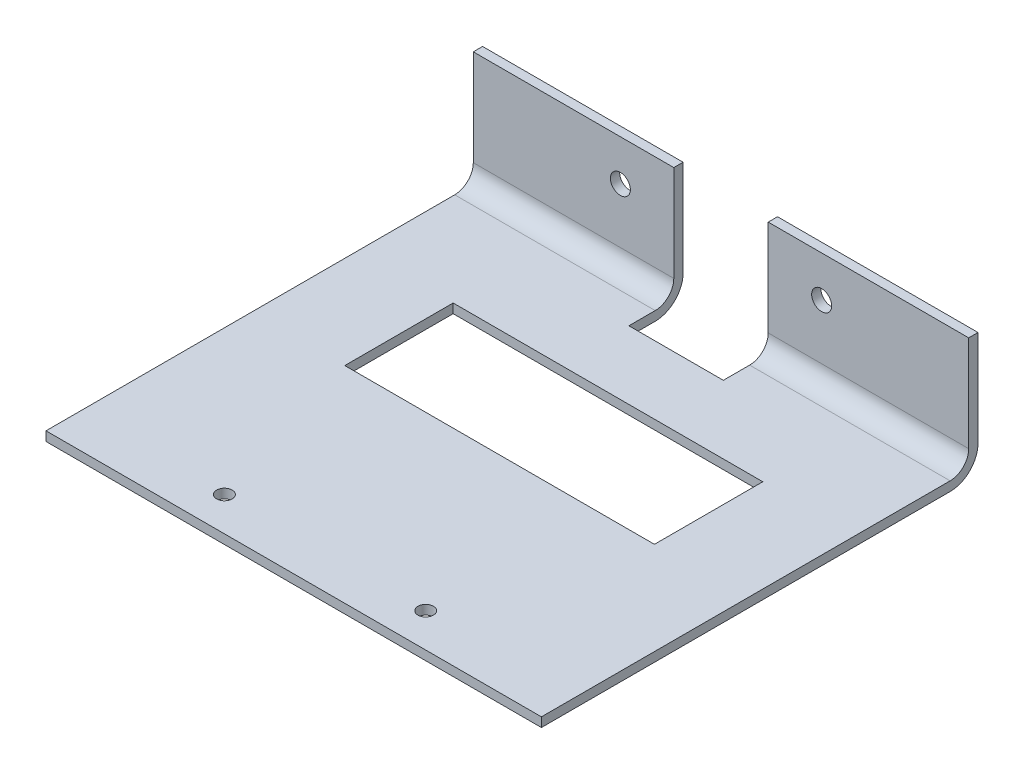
ISO-10303-21;
HEADER;
FILE_DESCRIPTION(('STEP AP214'),'2;1');
FILE_NAME('part.step','',(''),(''),'','','');
FILE_SCHEMA(('AUTOMOTIVE_DESIGN { 1 0 10303 214 1 1 1 1 }'));
ENDSEC;
DATA;
#1=APPLICATION_CONTEXT('core data for automotive mechanical design processes');
#2=APPLICATION_PROTOCOL_DEFINITION('international standard','automotive_design',2000,#1);
#3=PRODUCT_CONTEXT('',#1,'mechanical');
#4=PRODUCT('Part','Part','',(#3));
#5=PRODUCT_RELATED_PRODUCT_CATEGORY('part','',(#4));
#6=PRODUCT_DEFINITION_FORMATION('','',#4);
#7=PRODUCT_DEFINITION_CONTEXT('part definition',#1,'design');
#8=PRODUCT_DEFINITION('design','',#6,#7);
#9=PRODUCT_DEFINITION_SHAPE('','',#8);
#10=(LENGTH_UNIT() NAMED_UNIT(*) SI_UNIT(.MILLI.,.METRE.));
#11=(NAMED_UNIT(*) PLANE_ANGLE_UNIT() SI_UNIT($,.RADIAN.));
#12=(NAMED_UNIT(*) SI_UNIT($,.STERADIAN.) SOLID_ANGLE_UNIT());
#13=UNCERTAINTY_MEASURE_WITH_UNIT(LENGTH_MEASURE(1.E-05),#10,'distance_accuracy_value','');
#14=(GEOMETRIC_REPRESENTATION_CONTEXT(3) GLOBAL_UNCERTAINTY_ASSIGNED_CONTEXT((#13)) GLOBAL_UNIT_ASSIGNED_CONTEXT((#10,
#11,#12)) REPRESENTATION_CONTEXT('',''));
#15=CARTESIAN_POINT('',(0.,0.,0.));
#16=DIRECTION('',(0.,0.,1.));
#17=DIRECTION('',(1.,0.,0.));
#18=AXIS2_PLACEMENT_3D('',#15,#16,#17);
#19=CARTESIAN_POINT('',(160.,-53.6,0.));
#20=DIRECTION('',(0.,0.,-1.));
#21=DIRECTION('',(0.,1.,0.));
#22=AXIS2_PLACEMENT_3D('',#19,#20,#21);
#23=PLANE('',#22);
#24=DIRECTION('',(0.,-1.,0.));
#25=VECTOR('',#24,1.);
#26=CARTESIAN_POINT('',(30.5,-53.6,0.));
#27=LINE('',#26,#25);
#28=CARTESIAN_POINT('',(30.5,26.4,0.));
#29=VERTEX_POINT('',#28);
#30=CARTESIAN_POINT('',(30.5,-35.6,0.));
#31=VERTEX_POINT('',#30);
#32=EDGE_CURVE('E210',#29,#31,#27,.T.);
#33=ORIENTED_EDGE('',*,*,#32,.F.);
#34=DIRECTION('',(-1.,0.,0.));
#35=VECTOR('',#34,1.);
#36=CARTESIAN_POINT('',(160.,26.4,0.));
#37=LINE('',#36,#35);
#38=CARTESIAN_POINT('',(160.,26.4,0.));
#39=VERTEX_POINT('',#38);
#40=EDGE_CURVE('E290',#39,#29,#37,.T.);
#41=ORIENTED_EDGE('',*,*,#40,.F.);
#42=DIRECTION('',(0.,-1.,0.));
#43=VECTOR('',#42,1.);
#44=CARTESIAN_POINT('',(160.,-53.6,0.));
#45=LINE('',#44,#43);
#46=CARTESIAN_POINT('',(160.,-35.6,0.));
#47=VERTEX_POINT('',#46);
#48=EDGE_CURVE('E276',#39,#47,#45,.T.);
#49=ORIENTED_EDGE('',*,*,#48,.T.);
#50=DIRECTION('',(-1.,0.,0.));
#51=VECTOR('',#50,1.);
#52=CARTESIAN_POINT('',(160.,-35.6,0.));
#53=LINE('',#52,#51);
#54=EDGE_CURVE('E312',#47,#31,#53,.T.);
#55=ORIENTED_EDGE('',*,*,#54,.T.);
#56=EDGE_LOOP('',(#33,#41,#49,#55));
#57=FACE_BOUND('',#56,.T.);
#58=CARTESIAN_POINT('',(65.,0.,0.));
#59=DIRECTION('',(0.,0.,1.));
#60=DIRECTION('',(0.,1.,0.));
#61=AXIS2_PLACEMENT_3D('',#58,#59,#60);
#62=CIRCLE('',#61,6.45);
#63=CARTESIAN_POINT('',(65.,6.44999999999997,0.));
#64=VERTEX_POINT('',#63);
#65=EDGE_CURVE('E333',#64,#64,#62,.T.);
#66=ORIENTED_EDGE('',*,*,#65,.T.);
#67=EDGE_LOOP('',(#66));
#68=FACE_BOUND('',#67,.T.);
#69=ADVANCED_FACE('F35',(#57,#68),#23,.T.);
#70=CARTESIAN_POINT('',(160.,-53.6,6.));
#71=DIRECTION('',(0.,0.,-1.));
#72=DIRECTION('',(0.,1.,0.));
#73=AXIS2_PLACEMENT_3D('',#70,#71,#72);
#74=PLANE('',#73);
#75=DIRECTION('',(-1.,0.,0.));
#76=VECTOR('',#75,1.);
#77=CARTESIAN_POINT('',(160.,26.4,6.));
#78=LINE('',#77,#76);
#79=CARTESIAN_POINT('',(160.,26.4,6.));
#80=VERTEX_POINT('',#79);
#81=CARTESIAN_POINT('',(30.5,26.4,6.));
#82=VERTEX_POINT('',#81);
#83=EDGE_CURVE('E286',#80,#82,#78,.T.);
#84=ORIENTED_EDGE('',*,*,#83,.T.);
#85=DIRECTION('',(0.,-1.,0.));
#86=VECTOR('',#85,1.);
#87=CARTESIAN_POINT('',(30.5,-53.6,6.));
#88=LINE('',#87,#86);
#89=CARTESIAN_POINT('',(30.5,-35.6,6.));
#90=VERTEX_POINT('',#89);
#91=EDGE_CURVE('E215',#82,#90,#88,.T.);
#92=ORIENTED_EDGE('',*,*,#91,.T.);
#93=DIRECTION('',(-1.,0.,0.));
#94=VECTOR('',#93,1.);
#95=CARTESIAN_POINT('',(160.,-35.6,6.));
#96=LINE('',#95,#94);
#97=CARTESIAN_POINT('',(160.,-35.6,6.));
#98=VERTEX_POINT('',#97);
#99=EDGE_CURVE('E303',#90,#98,#96,.F.);
#100=ORIENTED_EDGE('',*,*,#99,.T.);
#101=DIRECTION('',(0.,-1.,0.));
#102=VECTOR('',#101,1.);
#103=CARTESIAN_POINT('',(160.,-53.6,6.));
#104=LINE('',#103,#102);
#105=EDGE_CURVE('E282',#80,#98,#104,.T.);
#106=ORIENTED_EDGE('',*,*,#105,.F.);
#107=EDGE_LOOP('',(#84,#92,#100,#106));
#108=FACE_BOUND('',#107,.T.);
#109=CARTESIAN_POINT('',(65.,0.,6.00000000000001));
#110=DIRECTION('',(0.,0.,-1.));
#111=DIRECTION('',(0.,1.,0.));
#112=AXIS2_PLACEMENT_3D('',#109,#110,#111);
#113=CIRCLE('',#112,6.45);
#114=CARTESIAN_POINT('',(65.,6.44999999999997,6.00000000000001));
#115=VERTEX_POINT('',#114);
#116=EDGE_CURVE('E39',#115,#115,#113,.F.);
#117=ORIENTED_EDGE('',*,*,#116,.F.);
#118=EDGE_LOOP('',(#117));
#119=FACE_BOUND('',#118,.T.);
#120=ADVANCED_FACE('F406',(#108,#119),#74,.F.);
#121=CARTESIAN_POINT('',(160.,26.4,6.));
#122=DIRECTION('',(0.,1.,0.));
#123=DIRECTION('',(0.,0.,1.));
#124=AXIS2_PLACEMENT_3D('',#121,#122,#123);
#125=PLANE('',#124);
#126=DIRECTION('',(0.,0.,-1.));
#127=VECTOR('',#126,1.);
#128=CARTESIAN_POINT('',(30.5,26.4,-40.));
#129=LINE('',#128,#127);
#130=EDGE_CURVE('E323',#82,#29,#129,.T.);
#131=ORIENTED_EDGE('',*,*,#130,.F.);
#132=ORIENTED_EDGE('',*,*,#83,.F.);
#133=DIRECTION('',(0.,0.,-1.));
#134=VECTOR('',#133,1.);
#135=CARTESIAN_POINT('',(160.,26.4,6.));
#136=LINE('',#135,#134);
#137=EDGE_CURVE('E279',#80,#39,#136,.T.);
#138=ORIENTED_EDGE('',*,*,#137,.T.);
#139=ORIENTED_EDGE('',*,*,#40,.T.);
#140=EDGE_LOOP('',(#131,#132,#138,#139));
#141=FACE_BOUND('',#140,.T.);
#142=ADVANCED_FACE('F375',(#141),#125,.T.);
#143=CARTESIAN_POINT('',(160.,-35.6,18.));
#144=DIRECTION('',(1.,0.,0.));
#145=DIRECTION('',(0.,0.,-1.));
#146=AXIS2_PLACEMENT_3D('',#143,#144,#145);
#147=CYLINDRICAL_SURFACE('',#146,12.);
#148=ORIENTED_EDGE('',*,*,#99,.F.);
#149=CARTESIAN_POINT('',(30.5,-35.6,18.));
#150=DIRECTION('',(1.,0.,0.));
#151=DIRECTION('',(0.,0.,-1.));
#152=AXIS2_PLACEMENT_3D('',#149,#150,#151);
#153=CIRCLE('',#152,12.);
#154=CARTESIAN_POINT('',(30.5,-47.6,18.));
#155=VERTEX_POINT('',#154);
#156=EDGE_CURVE('E212',#90,#155,#153,.F.);
#157=ORIENTED_EDGE('',*,*,#156,.T.);
#158=DIRECTION('',(-1.,0.,0.));
#159=VECTOR('',#158,1.);
#160=CARTESIAN_POINT('',(-160.,-47.6,18.));
#161=LINE('',#160,#159);
#162=CARTESIAN_POINT('',(160.,-47.6,18.));
#163=VERTEX_POINT('',#162);
#164=EDGE_CURVE('E300',#163,#155,#161,.T.);
#165=ORIENTED_EDGE('',*,*,#164,.F.);
#166=CARTESIAN_POINT('',(160.,-35.6,18.));
#167=DIRECTION('',(-1.,0.,0.));
#168=DIRECTION('',(0.,0.,1.));
#169=AXIS2_PLACEMENT_3D('',#166,#167,#168);
#170=CIRCLE('',#169,12.);
#171=EDGE_CURVE('E309',#98,#163,#170,.T.);
#172=ORIENTED_EDGE('',*,*,#171,.F.);
#173=EDGE_LOOP('',(#148,#157,#165,#172));
#174=FACE_BOUND('',#173,.T.);
#175=ADVANCED_FACE('F383',(#174),#147,.F.);
#176=CARTESIAN_POINT('',(160.,-35.6,18.));
#177=DIRECTION('',(-1.,0.,0.));
#178=DIRECTION('',(0.,0.,1.));
#179=AXIS2_PLACEMENT_3D('',#176,#177,#178);
#180=CYLINDRICAL_SURFACE('',#179,18.);
#181=CARTESIAN_POINT('',(30.5,-35.6,18.));
#182=DIRECTION('',(1.,0.,0.));
#183=DIRECTION('',(0.,0.,-1.));
#184=AXIS2_PLACEMENT_3D('',#181,#182,#183);
#185=CIRCLE('',#184,18.);
#186=CARTESIAN_POINT('',(30.5,-53.6000000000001,18.));
#187=VERTEX_POINT('',#186);
#188=EDGE_CURVE('E11',#31,#187,#185,.F.);
#189=ORIENTED_EDGE('',*,*,#188,.F.);
#190=ORIENTED_EDGE('',*,*,#54,.F.);
#191=CARTESIAN_POINT('',(160.,-35.6,18.));
#192=DIRECTION('',(-1.,0.,0.));
#193=DIRECTION('',(0.,0.,1.));
#194=AXIS2_PLACEMENT_3D('',#191,#192,#193);
#195=CIRCLE('',#194,18.);
#196=CARTESIAN_POINT('',(160.,-53.6,18.));
#197=VERTEX_POINT('',#196);
#198=EDGE_CURVE('E319',#197,#47,#195,.F.);
#199=ORIENTED_EDGE('',*,*,#198,.F.);
#200=DIRECTION('',(-1.,0.,0.));
#201=VECTOR('',#200,1.);
#202=CARTESIAN_POINT('',(160.,-53.6,18.));
#203=LINE('',#202,#201);
#204=EDGE_CURVE('E317',#187,#197,#203,.F.);
#205=ORIENTED_EDGE('',*,*,#204,.F.);
#206=EDGE_LOOP('',(#189,#190,#199,#205));
#207=FACE_BOUND('',#206,.T.);
#208=ADVANCED_FACE('F363',(#207),#180,.T.);
#209=CARTESIAN_POINT('',(160.,-47.6,0.));
#210=DIRECTION('',(0.,-1.,0.));
#211=DIRECTION('',(0.,0.,-1.));
#212=AXIS2_PLACEMENT_3D('',#209,#210,#211);
#213=PLANE('',#212);
#214=CARTESIAN_POINT('',(-66.75,-47.6,260.));
#215=DIRECTION('',(0.,1.,0.));
#216=DIRECTION('',(0.,0.,1.));
#217=AXIS2_PLACEMENT_3D('',#214,#215,#216);
#218=CIRCLE('',#217,5.00000000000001);
#219=CARTESIAN_POINT('',(-66.75,-47.6,265.));
#220=VERTEX_POINT('',#219);
#221=EDGE_CURVE('E472',#220,#220,#218,.T.);
#222=ORIENTED_EDGE('',*,*,#221,.F.);
#223=EDGE_LOOP('',(#222));
#224=FACE_BOUND('',#223,.T.);
#225=CARTESIAN_POINT('',(63.25,-47.6,260.));
#226=DIRECTION('',(0.,1.,0.));
#227=DIRECTION('',(0.,0.,1.));
#228=AXIS2_PLACEMENT_3D('',#225,#226,#227);
#229=CIRCLE('',#228,5.00000000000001);
#230=CARTESIAN_POINT('',(63.25,-47.6,265.));
#231=VERTEX_POINT('',#230);
#232=EDGE_CURVE('E475',#231,#231,#229,.T.);
#233=ORIENTED_EDGE('',*,*,#232,.F.);
#234=EDGE_LOOP('',(#233));
#235=FACE_BOUND('',#234,.T.);
#236=DIRECTION('',(-1.,0.,0.));
#237=VECTOR('',#236,1.);
#238=CARTESIAN_POINT('',(100.,-47.6,79.));
#239=LINE('',#238,#237);
#240=CARTESIAN_POINT('',(100.,-47.6,79.));
#241=VERTEX_POINT('',#240);
#242=CARTESIAN_POINT('',(-100.,-47.6,79.));
#243=VERTEX_POINT('',#242);
#244=EDGE_CURVE('E224',#241,#243,#239,.T.);
#245=ORIENTED_EDGE('',*,*,#244,.F.);
#246=DIRECTION('',(0.,0.,-1.));
#247=VECTOR('',#246,1.);
#248=CARTESIAN_POINT('',(100.,-47.6,79.));
#249=LINE('',#248,#247);
#250=CARTESIAN_POINT('',(100.,-47.6,149.));
#251=VERTEX_POINT('',#250);
#252=EDGE_CURVE('E60',#251,#241,#249,.T.);
#253=ORIENTED_EDGE('',*,*,#252,.F.);
#254=DIRECTION('',(1.,0.,0.));
#255=VECTOR('',#254,1.);
#256=CARTESIAN_POINT('',(100.,-47.6,149.));
#257=LINE('',#256,#255);
#258=CARTESIAN_POINT('',(-100.,-47.6,149.));
#259=VERTEX_POINT('',#258);
#260=EDGE_CURVE('E230',#259,#251,#257,.T.);
#261=ORIENTED_EDGE('',*,*,#260,.F.);
#262=DIRECTION('',(0.,0.,1.));
#263=VECTOR('',#262,1.);
#264=CARTESIAN_POINT('',(-100.,-47.6,79.));
#265=LINE('',#264,#263);
#266=EDGE_CURVE('E227',#243,#259,#265,.T.);
#267=ORIENTED_EDGE('',*,*,#266,.F.);
#268=EDGE_LOOP('',(#245,#253,#261,#267));
#269=FACE_BOUND('',#268,.T.);
#270=ORIENTED_EDGE('',*,*,#164,.T.);
#271=DIRECTION('',(0.,0.,1.));
#272=VECTOR('',#271,1.);
#273=CARTESIAN_POINT('',(30.5,-47.6,0.));
#274=LINE('',#273,#272);
#275=CARTESIAN_POINT('',(30.5,-47.6,35.));
#276=VERTEX_POINT('',#275);
#277=EDGE_CURVE('E218',#155,#276,#274,.T.);
#278=ORIENTED_EDGE('',*,*,#277,.T.);
#279=DIRECTION('',(-1.,0.,0.));
#280=VECTOR('',#279,1.);
#281=CARTESIAN_POINT('',(160.,-47.6,35.));
#282=LINE('',#281,#280);
#283=CARTESIAN_POINT('',(-30.5,-47.6,35.));
#284=VERTEX_POINT('',#283);
#285=EDGE_CURVE('E221',#276,#284,#282,.T.);
#286=ORIENTED_EDGE('',*,*,#285,.T.);
#287=DIRECTION('',(0.,0.,-1.));
#288=VECTOR('',#287,1.);
#289=CARTESIAN_POINT('',(-30.5,-47.6,0.));
#290=LINE('',#289,#288);
#291=CARTESIAN_POINT('',(-30.5,-47.6,18.));
#292=VERTEX_POINT('',#291);
#293=EDGE_CURVE('E175',#284,#292,#290,.T.);
#294=ORIENTED_EDGE('',*,*,#293,.T.);
#295=CARTESIAN_POINT('',(-160.,-47.6,18.));
#296=VERTEX_POINT('',#295);
#297=EDGE_CURVE('E299',#292,#296,#161,.T.);
#298=ORIENTED_EDGE('',*,*,#297,.T.);
#299=DIRECTION('',(0.,0.,1.));
#300=VECTOR('',#299,1.);
#301=CARTESIAN_POINT('',(-160.,-47.6,0.));
#302=LINE('',#301,#300);
#303=CARTESIAN_POINT('',(-160.,-47.6,282.));
#304=VERTEX_POINT('',#303);
#305=EDGE_CURVE('E248',#296,#304,#302,.T.);
#306=ORIENTED_EDGE('',*,*,#305,.T.);
#307=DIRECTION('',(-1.,0.,0.));
#308=VECTOR('',#307,1.);
#309=CARTESIAN_POINT('',(160.,-47.6,282.));
#310=LINE('',#309,#308);
#311=CARTESIAN_POINT('',(160.,-47.6,282.));
#312=VERTEX_POINT('',#311);
#313=EDGE_CURVE('E296',#312,#304,#310,.T.);
#314=ORIENTED_EDGE('',*,*,#313,.F.);
#315=DIRECTION('',(0.,0.,1.));
#316=VECTOR('',#315,1.);
#317=CARTESIAN_POINT('',(160.,-47.6,0.));
#318=LINE('',#317,#316);
#319=EDGE_CURVE('E269',#163,#312,#318,.T.);
#320=ORIENTED_EDGE('',*,*,#319,.F.);
#321=EDGE_LOOP('',(#270,#278,#286,#294,#298,#306,#314,#320));
#322=FACE_BOUND('',#321,.T.);
#323=ADVANCED_FACE('F37',(#224,#235,#269,#322),#213,.F.);
#324=CARTESIAN_POINT('',(160.,-53.6,282.));
#325=DIRECTION('',(0.,0.,1.));
#326=DIRECTION('',(1.,0.,0.));
#327=AXIS2_PLACEMENT_3D('',#324,#325,#326);
#328=PLANE('',#327);
#329=ORIENTED_EDGE('',*,*,#313,.T.);
#330=DIRECTION('',(0.,1.,0.));
#331=VECTOR('',#330,1.);
#332=CARTESIAN_POINT('',(-160.,-53.6,282.));
#333=LINE('',#332,#331);
#334=CARTESIAN_POINT('',(-160.,-53.6,282.));
#335=VERTEX_POINT('',#334);
#336=EDGE_CURVE('E255',#335,#304,#333,.T.);
#337=ORIENTED_EDGE('',*,*,#336,.F.);
#338=DIRECTION('',(-1.,0.,0.));
#339=VECTOR('',#338,1.);
#340=CARTESIAN_POINT('',(160.,-53.6,282.));
#341=LINE('',#340,#339);
#342=CARTESIAN_POINT('',(160.,-53.6,282.));
#343=VERTEX_POINT('',#342);
#344=EDGE_CURVE('E293',#343,#335,#341,.T.);
#345=ORIENTED_EDGE('',*,*,#344,.F.);
#346=DIRECTION('',(0.,1.,0.));
#347=VECTOR('',#346,1.);
#348=CARTESIAN_POINT('',(160.,-53.6,282.));
#349=LINE('',#348,#347);
#350=EDGE_CURVE('E271',#343,#312,#349,.T.);
#351=ORIENTED_EDGE('',*,*,#350,.T.);
#352=EDGE_LOOP('',(#329,#337,#345,#351));
#353=FACE_BOUND('',#352,.T.);
#354=ADVANCED_FACE('F387',(#353),#328,.T.);
#355=CARTESIAN_POINT('',(160.,-53.6,0.));
#356=DIRECTION('',(0.,-1.,0.));
#357=DIRECTION('',(0.,0.,-1.));
#358=AXIS2_PLACEMENT_3D('',#355,#356,#357);
#359=PLANE('',#358);
#360=CARTESIAN_POINT('',(-66.75,-53.6000000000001,260.));
#361=DIRECTION('',(0.,1.,0.));
#362=DIRECTION('',(0.,0.,1.));
#363=AXIS2_PLACEMENT_3D('',#360,#361,#362);
#364=CIRCLE('',#363,5.00000000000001);
#365=CARTESIAN_POINT('',(-66.75,-53.6000000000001,265.));
#366=VERTEX_POINT('',#365);
#367=EDGE_CURVE('E469',#366,#366,#364,.T.);
#368=ORIENTED_EDGE('',*,*,#367,.T.);
#369=EDGE_LOOP('',(#368));
#370=FACE_BOUND('',#369,.T.);
#371=CARTESIAN_POINT('',(63.25,-53.6000000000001,260.));
#372=DIRECTION('',(0.,1.,0.));
#373=DIRECTION('',(0.,0.,1.));
#374=AXIS2_PLACEMENT_3D('',#371,#372,#373);
#375=CIRCLE('',#374,5.00000000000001);
#376=CARTESIAN_POINT('',(63.25,-53.6000000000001,265.));
#377=VERTEX_POINT('',#376);
#378=EDGE_CURVE('E479',#377,#377,#375,.T.);
#379=ORIENTED_EDGE('',*,*,#378,.T.);
#380=EDGE_LOOP('',(#379));
#381=FACE_BOUND('',#380,.T.);
#382=DIRECTION('',(0.,0.,-1.));
#383=VECTOR('',#382,1.);
#384=CARTESIAN_POINT('',(30.5,-53.6000000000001,-40.));
#385=LINE('',#384,#383);
#386=CARTESIAN_POINT('',(30.5,-53.6000000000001,35.));
#387=VERTEX_POINT('',#386);
#388=EDGE_CURVE('E194',#387,#187,#385,.T.);
#389=ORIENTED_EDGE('',*,*,#388,.T.);
#390=ORIENTED_EDGE('',*,*,#204,.T.);
#391=DIRECTION('',(0.,0.,1.));
#392=VECTOR('',#391,1.);
#393=CARTESIAN_POINT('',(160.,-53.6,0.));
#394=LINE('',#393,#392);
#395=EDGE_CURVE('E274',#197,#343,#394,.T.);
#396=ORIENTED_EDGE('',*,*,#395,.T.);
#397=ORIENTED_EDGE('',*,*,#344,.T.);
#398=DIRECTION('',(0.,0.,1.));
#399=VECTOR('',#398,1.);
#400=CARTESIAN_POINT('',(-160.,-53.6,0.));
#401=LINE('',#400,#399);
#402=CARTESIAN_POINT('',(-160.,-53.6,18.));
#403=VERTEX_POINT('',#402);
#404=EDGE_CURVE('E258',#403,#335,#401,.T.);
#405=ORIENTED_EDGE('',*,*,#404,.F.);
#406=CARTESIAN_POINT('',(-30.5,-53.6,18.));
#407=VERTEX_POINT('',#406);
#408=EDGE_CURVE('E193',#403,#407,#203,.F.);
#409=ORIENTED_EDGE('',*,*,#408,.T.);
#410=DIRECTION('',(0.,0.,1.));
#411=VECTOR('',#410,1.);
#412=CARTESIAN_POINT('',(-30.5,-53.6000000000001,-40.));
#413=LINE('',#412,#411);
#414=CARTESIAN_POINT('',(-30.5,-53.6000000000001,35.));
#415=VERTEX_POINT('',#414);
#416=EDGE_CURVE('E52',#407,#415,#413,.T.);
#417=ORIENTED_EDGE('',*,*,#416,.T.);
#418=DIRECTION('',(1.,0.,0.));
#419=VECTOR('',#418,1.);
#420=CARTESIAN_POINT('',(30.5,-53.6000000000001,35.));
#421=LINE('',#420,#419);
#422=EDGE_CURVE('E179',#415,#387,#421,.T.);
#423=ORIENTED_EDGE('',*,*,#422,.T.);
#424=EDGE_LOOP('',(#389,#390,#396,#397,#405,#409,#417,#423));
#425=FACE_BOUND('',#424,.T.);
#426=DIRECTION('',(0.,0.,-1.));
#427=VECTOR('',#426,1.);
#428=CARTESIAN_POINT('',(100.,-53.6,79.));
#429=LINE('',#428,#427);
#430=CARTESIAN_POINT('',(100.,-53.6000000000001,149.));
#431=VERTEX_POINT('',#430);
#432=CARTESIAN_POINT('',(100.,-53.6,79.));
#433=VERTEX_POINT('',#432);
#434=EDGE_CURVE('E233',#431,#433,#429,.T.);
#435=ORIENTED_EDGE('',*,*,#434,.T.);
#436=DIRECTION('',(-1.,0.,0.));
#437=VECTOR('',#436,1.);
#438=CARTESIAN_POINT('',(100.,-53.6,79.));
#439=LINE('',#438,#437);
#440=CARTESIAN_POINT('',(-100.,-53.6,79.));
#441=VERTEX_POINT('',#440);
#442=EDGE_CURVE('E236',#433,#441,#439,.T.);
#443=ORIENTED_EDGE('',*,*,#442,.T.);
#444=DIRECTION('',(0.,0.,1.));
#445=VECTOR('',#444,1.);
#446=CARTESIAN_POINT('',(-100.,-53.6,79.));
#447=LINE('',#446,#445);
#448=CARTESIAN_POINT('',(-100.,-53.6000000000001,149.));
#449=VERTEX_POINT('',#448);
#450=EDGE_CURVE('E239',#441,#449,#447,.T.);
#451=ORIENTED_EDGE('',*,*,#450,.T.);
#452=DIRECTION('',(1.,0.,0.));
#453=VECTOR('',#452,1.);
#454=CARTESIAN_POINT('',(100.,-53.6000000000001,149.));
#455=LINE('',#454,#453);
#456=EDGE_CURVE('E242',#449,#431,#455,.T.);
#457=ORIENTED_EDGE('',*,*,#456,.T.);
#458=EDGE_LOOP('',(#435,#443,#451,#457));
#459=FACE_BOUND('',#458,.T.);
#460=ADVANCED_FACE('F189',(#370,#381,#425,#459),#359,.T.);
#461=CARTESIAN_POINT('',(-65.,0.,0.));
#462=DIRECTION('',(0.,0.,-1.));
#463=DIRECTION('',(0.,1.,0.));
#464=AXIS2_PLACEMENT_3D('',#461,#462,#463);
#465=CIRCLE('',#464,6.45);
#466=CARTESIAN_POINT('',(-65.,6.44999999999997,0.));
#467=VERTEX_POINT('',#466);
#468=EDGE_CURVE('E324',#467,#467,#465,.T.);
#469=ORIENTED_EDGE('',*,*,#468,.F.);
#470=EDGE_LOOP('',(#469));
#471=FACE_BOUND('',#470,.T.);
#472=DIRECTION('',(0.,1.,0.));
#473=VECTOR('',#472,1.);
#474=CARTESIAN_POINT('',(-30.5,-53.6,0.));
#475=LINE('',#474,#473);
#476=CARTESIAN_POINT('',(-30.5,-35.6,0.));
#477=VERTEX_POINT('',#476);
#478=CARTESIAN_POINT('',(-30.5,26.4,0.));
#479=VERTEX_POINT('',#478);
#480=EDGE_CURVE('E200',#477,#479,#475,.T.);
#481=ORIENTED_EDGE('',*,*,#480,.F.);
#482=CARTESIAN_POINT('',(-160.,-35.6,0.));
#483=VERTEX_POINT('',#482);
#484=EDGE_CURVE('E311',#477,#483,#53,.T.);
#485=ORIENTED_EDGE('',*,*,#484,.T.);
#486=DIRECTION('',(0.,-1.,0.));
#487=VECTOR('',#486,1.);
#488=CARTESIAN_POINT('',(-160.,-53.6,0.));
#489=LINE('',#488,#487);
#490=CARTESIAN_POINT('',(-160.,26.4,0.));
#491=VERTEX_POINT('',#490);
#492=EDGE_CURVE('E260',#491,#483,#489,.T.);
#493=ORIENTED_EDGE('',*,*,#492,.F.);
#494=EDGE_CURVE('E289',#479,#491,#37,.T.);
#495=ORIENTED_EDGE('',*,*,#494,.F.);
#496=EDGE_LOOP('',(#481,#485,#493,#495));
#497=FACE_BOUND('',#496,.T.);
#498=ADVANCED_FACE('F394',(#471,#497),#23,.T.);
#499=DIRECTION('',(0.,0.,1.));
#500=VECTOR('',#499,1.);
#501=CARTESIAN_POINT('',(-30.5,26.4,-40.));
#502=LINE('',#501,#500);
#503=CARTESIAN_POINT('',(-30.5,26.4,6.));
#504=VERTEX_POINT('',#503);
#505=EDGE_CURVE('E196',#479,#504,#502,.T.);
#506=ORIENTED_EDGE('',*,*,#505,.F.);
#507=ORIENTED_EDGE('',*,*,#494,.T.);
#508=DIRECTION('',(0.,0.,-1.));
#509=VECTOR('',#508,1.);
#510=CARTESIAN_POINT('',(-160.,26.4,6.));
#511=LINE('',#510,#509);
#512=CARTESIAN_POINT('',(-160.,26.4,6.));
#513=VERTEX_POINT('',#512);
#514=EDGE_CURVE('E263',#513,#491,#511,.T.);
#515=ORIENTED_EDGE('',*,*,#514,.F.);
#516=EDGE_CURVE('E285',#504,#513,#78,.T.);
#517=ORIENTED_EDGE('',*,*,#516,.F.);
#518=EDGE_LOOP('',(#506,#507,#515,#517));
#519=FACE_BOUND('',#518,.T.);
#520=ADVANCED_FACE('F345',(#519),#125,.T.);
#521=CARTESIAN_POINT('',(-65.,0.,6.00000000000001));
#522=DIRECTION('',(0.,0.,-1.));
#523=DIRECTION('',(0.,1.,0.));
#524=AXIS2_PLACEMENT_3D('',#521,#522,#523);
#525=CIRCLE('',#524,6.45);
#526=CARTESIAN_POINT('',(-65.,6.44999999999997,6.00000000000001));
#527=VERTEX_POINT('',#526);
#528=EDGE_CURVE('E321',#527,#527,#525,.T.);
#529=ORIENTED_EDGE('',*,*,#528,.T.);
#530=EDGE_LOOP('',(#529));
#531=FACE_BOUND('',#530,.T.);
#532=CARTESIAN_POINT('',(-160.,-35.6,6.));
#533=VERTEX_POINT('',#532);
#534=CARTESIAN_POINT('',(-30.5,-35.6,6.));
#535=VERTEX_POINT('',#534);
#536=EDGE_CURVE('E304',#533,#535,#96,.F.);
#537=ORIENTED_EDGE('',*,*,#536,.T.);
#538=DIRECTION('',(0.,1.,0.));
#539=VECTOR('',#538,1.);
#540=CARTESIAN_POINT('',(-30.5,-53.6,6.));
#541=LINE('',#540,#539);
#542=EDGE_CURVE('E206',#535,#504,#541,.T.);
#543=ORIENTED_EDGE('',*,*,#542,.T.);
#544=ORIENTED_EDGE('',*,*,#516,.T.);
#545=DIRECTION('',(0.,-1.,0.));
#546=VECTOR('',#545,1.);
#547=CARTESIAN_POINT('',(-160.,-53.6,6.));
#548=LINE('',#547,#546);
#549=EDGE_CURVE('E266',#513,#533,#548,.T.);
#550=ORIENTED_EDGE('',*,*,#549,.T.);
#551=EDGE_LOOP('',(#537,#543,#544,#550));
#552=FACE_BOUND('',#551,.T.);
#553=ADVANCED_FACE('F342',(#531,#552),#74,.F.);
#554=CARTESIAN_POINT('',(160.,-47.6,282.));
#555=DIRECTION('',(-1.,0.,0.));
#556=DIRECTION('',(0.,0.,1.));
#557=AXIS2_PLACEMENT_3D('',#554,#555,#556);
#558=PLANE('',#557);
#559=ORIENTED_EDGE('',*,*,#395,.F.);
#560=ORIENTED_EDGE('',*,*,#198,.T.);
#561=ORIENTED_EDGE('',*,*,#48,.F.);
#562=ORIENTED_EDGE('',*,*,#137,.F.);
#563=ORIENTED_EDGE('',*,*,#105,.T.);
#564=ORIENTED_EDGE('',*,*,#171,.T.);
#565=ORIENTED_EDGE('',*,*,#319,.T.);
#566=ORIENTED_EDGE('',*,*,#350,.F.);
#567=EDGE_LOOP('',(#559,#560,#561,#562,#563,#564,#565,#566));
#568=FACE_BOUND('',#567,.T.);
#569=ADVANCED_FACE('F367',(#568),#558,.F.);
#570=CARTESIAN_POINT('',(-160.,-47.6,282.));
#571=DIRECTION('',(-1.,0.,0.));
#572=DIRECTION('',(0.,0.,1.));
#573=AXIS2_PLACEMENT_3D('',#570,#571,#572);
#574=PLANE('',#573);
#575=ORIENTED_EDGE('',*,*,#492,.T.);
#576=CARTESIAN_POINT('',(-160.,-35.6,18.));
#577=DIRECTION('',(-1.,0.,0.));
#578=DIRECTION('',(0.,0.,1.));
#579=AXIS2_PLACEMENT_3D('',#576,#577,#578);
#580=CIRCLE('',#579,18.);
#581=EDGE_CURVE('E315',#483,#403,#580,.T.);
#582=ORIENTED_EDGE('',*,*,#581,.T.);
#583=ORIENTED_EDGE('',*,*,#404,.T.);
#584=ORIENTED_EDGE('',*,*,#336,.T.);
#585=ORIENTED_EDGE('',*,*,#305,.F.);
#586=CARTESIAN_POINT('',(-160.,-35.6,18.));
#587=DIRECTION('',(-1.,0.,0.));
#588=DIRECTION('',(0.,0.,1.));
#589=AXIS2_PLACEMENT_3D('',#586,#587,#588);
#590=CIRCLE('',#589,12.);
#591=EDGE_CURVE('E307',#296,#533,#590,.F.);
#592=ORIENTED_EDGE('',*,*,#591,.T.);
#593=ORIENTED_EDGE('',*,*,#549,.F.);
#594=ORIENTED_EDGE('',*,*,#514,.T.);
#595=EDGE_LOOP('',(#575,#582,#583,#584,#585,#592,#593,#594));
#596=FACE_BOUND('',#595,.T.);
#597=ADVANCED_FACE('F349',(#596),#574,.T.);
#598=ORIENTED_EDGE('',*,*,#297,.F.);
#599=CARTESIAN_POINT('',(-30.5,-35.6,18.));
#600=DIRECTION('',(-1.,0.,0.));
#601=DIRECTION('',(0.,0.,1.));
#602=AXIS2_PLACEMENT_3D('',#599,#600,#601);
#603=CIRCLE('',#602,12.);
#604=EDGE_CURVE('E203',#292,#535,#603,.F.);
#605=ORIENTED_EDGE('',*,*,#604,.T.);
#606=ORIENTED_EDGE('',*,*,#536,.F.);
#607=ORIENTED_EDGE('',*,*,#591,.F.);
#608=EDGE_LOOP('',(#598,#605,#606,#607));
#609=FACE_BOUND('',#608,.T.);
#610=ADVANCED_FACE('F354',(#609),#147,.F.);
#611=CARTESIAN_POINT('',(-30.5,-35.6,18.));
#612=DIRECTION('',(-1.,0.,0.));
#613=DIRECTION('',(0.,0.,1.));
#614=AXIS2_PLACEMENT_3D('',#611,#612,#613);
#615=CIRCLE('',#614,18.);
#616=EDGE_CURVE('E44',#407,#477,#615,.F.);
#617=ORIENTED_EDGE('',*,*,#616,.F.);
#618=ORIENTED_EDGE('',*,*,#408,.F.);
#619=ORIENTED_EDGE('',*,*,#581,.F.);
#620=ORIENTED_EDGE('',*,*,#484,.F.);
#621=EDGE_LOOP('',(#617,#618,#619,#620));
#622=FACE_BOUND('',#621,.T.);
#623=ADVANCED_FACE('F391',(#622),#180,.T.);
#624=CARTESIAN_POINT('',(100.,-53.6,79.));
#625=DIRECTION('',(1.,0.,0.));
#626=DIRECTION('',(0.,0.,-1.));
#627=AXIS2_PLACEMENT_3D('',#624,#625,#626);
#628=PLANE('',#627);
#629=ORIENTED_EDGE('',*,*,#252,.T.);
#630=DIRECTION('',(0.,1.,0.));
#631=VECTOR('',#630,1.);
#632=CARTESIAN_POINT('',(100.,-53.6,79.));
#633=LINE('',#632,#631);
#634=EDGE_CURVE('E245',#433,#241,#633,.T.);
#635=ORIENTED_EDGE('',*,*,#634,.F.);
#636=ORIENTED_EDGE('',*,*,#434,.F.);
#637=DIRECTION('',(0.,1.,0.));
#638=VECTOR('',#637,1.);
#639=CARTESIAN_POINT('',(100.,-53.6000000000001,149.));
#640=LINE('',#639,#638);
#641=EDGE_CURVE('E246',#431,#251,#640,.T.);
#642=ORIENTED_EDGE('',*,*,#641,.T.);
#643=EDGE_LOOP('',(#629,#635,#636,#642));
#644=FACE_BOUND('',#643,.T.);
#645=ADVANCED_FACE('F429',(#644),#628,.F.);
#646=CARTESIAN_POINT('',(100.,-53.6000000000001,149.));
#647=DIRECTION('',(0.,0.,1.));
#648=DIRECTION('',(0.,-1.,0.));
#649=AXIS2_PLACEMENT_3D('',#646,#647,#648);
#650=PLANE('',#649);
#651=ORIENTED_EDGE('',*,*,#260,.T.);
#652=ORIENTED_EDGE('',*,*,#641,.F.);
#653=ORIENTED_EDGE('',*,*,#456,.F.);
#654=DIRECTION('',(0.,1.,0.));
#655=VECTOR('',#654,1.);
#656=CARTESIAN_POINT('',(-100.,-53.6000000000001,149.));
#657=LINE('',#656,#655);
#658=EDGE_CURVE('E249',#449,#259,#657,.T.);
#659=ORIENTED_EDGE('',*,*,#658,.T.);
#660=EDGE_LOOP('',(#651,#652,#653,#659));
#661=FACE_BOUND('',#660,.T.);
#662=ADVANCED_FACE('F432',(#661),#650,.F.);
#663=CARTESIAN_POINT('',(-100.,-53.6,79.));
#664=DIRECTION('',(-1.,0.,0.));
#665=DIRECTION('',(0.,0.,1.));
#666=AXIS2_PLACEMENT_3D('',#663,#664,#665);
#667=PLANE('',#666);
#668=ORIENTED_EDGE('',*,*,#266,.T.);
#669=ORIENTED_EDGE('',*,*,#658,.F.);
#670=ORIENTED_EDGE('',*,*,#450,.F.);
#671=DIRECTION('',(0.,1.,0.));
#672=VECTOR('',#671,1.);
#673=CARTESIAN_POINT('',(-100.,-53.6,79.));
#674=LINE('',#673,#672);
#675=EDGE_CURVE('E251',#441,#243,#674,.T.);
#676=ORIENTED_EDGE('',*,*,#675,.T.);
#677=EDGE_LOOP('',(#668,#669,#670,#676));
#678=FACE_BOUND('',#677,.T.);
#679=ADVANCED_FACE('F436',(#678),#667,.F.);
#680=CARTESIAN_POINT('',(100.,-53.6,79.));
#681=DIRECTION('',(0.,0.,-1.));
#682=DIRECTION('',(0.,1.,0.));
#683=AXIS2_PLACEMENT_3D('',#680,#681,#682);
#684=PLANE('',#683);
#685=ORIENTED_EDGE('',*,*,#244,.T.);
#686=ORIENTED_EDGE('',*,*,#675,.F.);
#687=ORIENTED_EDGE('',*,*,#442,.F.);
#688=ORIENTED_EDGE('',*,*,#634,.T.);
#689=EDGE_LOOP('',(#685,#686,#687,#688));
#690=FACE_BOUND('',#689,.T.);
#691=ADVANCED_FACE('F433',(#690),#684,.F.);
#692=CARTESIAN_POINT('',(30.5,-53.6000000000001,35.));
#693=DIRECTION('',(0.,0.,1.));
#694=DIRECTION('',(1.,0.,0.));
#695=AXIS2_PLACEMENT_3D('',#692,#693,#694);
#696=PLANE('',#695);
#697=DIRECTION('',(0.,1.,0.));
#698=VECTOR('',#697,1.);
#699=CARTESIAN_POINT('',(30.5,-53.6000000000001,35.));
#700=LINE('',#699,#698);
#701=EDGE_CURVE('E178',#387,#276,#700,.T.);
#702=ORIENTED_EDGE('',*,*,#701,.F.);
#703=ORIENTED_EDGE('',*,*,#422,.F.);
#704=DIRECTION('',(0.,1.,0.));
#705=VECTOR('',#704,1.);
#706=CARTESIAN_POINT('',(-30.5,-53.6000000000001,35.));
#707=LINE('',#706,#705);
#708=EDGE_CURVE('E171',#415,#284,#707,.T.);
#709=ORIENTED_EDGE('',*,*,#708,.T.);
#710=ORIENTED_EDGE('',*,*,#285,.F.);
#711=EDGE_LOOP('',(#702,#703,#709,#710));
#712=FACE_BOUND('',#711,.T.);
#713=ADVANCED_FACE('F182',(#712),#696,.F.);
#714=CARTESIAN_POINT('',(30.5,-53.6000000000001,-40.));
#715=DIRECTION('',(1.,0.,0.));
#716=DIRECTION('',(0.,0.,-1.));
#717=AXIS2_PLACEMENT_3D('',#714,#715,#716);
#718=PLANE('',#717);
#719=ORIENTED_EDGE('',*,*,#156,.F.);
#720=ORIENTED_EDGE('',*,*,#91,.F.);
#721=ORIENTED_EDGE('',*,*,#130,.T.);
#722=ORIENTED_EDGE('',*,*,#32,.T.);
#723=ORIENTED_EDGE('',*,*,#188,.T.);
#724=ORIENTED_EDGE('',*,*,#388,.F.);
#725=ORIENTED_EDGE('',*,*,#701,.T.);
#726=ORIENTED_EDGE('',*,*,#277,.F.);
#727=EDGE_LOOP('',(#719,#720,#721,#722,#723,#724,#725,#726));
#728=FACE_BOUND('',#727,.T.);
#729=ADVANCED_FACE('F357',(#728),#718,.F.);
#730=CARTESIAN_POINT('',(-30.5,-53.6000000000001,-40.));
#731=DIRECTION('',(-1.,0.,0.));
#732=DIRECTION('',(0.,0.,1.));
#733=AXIS2_PLACEMENT_3D('',#730,#731,#732);
#734=PLANE('',#733);
#735=ORIENTED_EDGE('',*,*,#708,.F.);
#736=ORIENTED_EDGE('',*,*,#416,.F.);
#737=ORIENTED_EDGE('',*,*,#616,.T.);
#738=ORIENTED_EDGE('',*,*,#480,.T.);
#739=ORIENTED_EDGE('',*,*,#505,.T.);
#740=ORIENTED_EDGE('',*,*,#542,.F.);
#741=ORIENTED_EDGE('',*,*,#604,.F.);
#742=ORIENTED_EDGE('',*,*,#293,.F.);
#743=EDGE_LOOP('',(#735,#736,#737,#738,#739,#740,#741,#742));
#744=FACE_BOUND('',#743,.T.);
#745=ADVANCED_FACE('F173',(#744),#734,.F.);
#746=CARTESIAN_POINT('',(-65.,0.,282.));
#747=DIRECTION('',(0.,0.,-1.));
#748=DIRECTION('',(0.,1.,0.));
#749=AXIS2_PLACEMENT_3D('',#746,#747,#748);
#750=CYLINDRICAL_SURFACE('',#749,6.45);
#751=ORIENTED_EDGE('',*,*,#468,.T.);
#752=EDGE_LOOP('',(#751));
#753=FACE_BOUND('',#752,.T.);
#754=ORIENTED_EDGE('',*,*,#528,.F.);
#755=EDGE_LOOP('',(#754));
#756=FACE_BOUND('',#755,.T.);
#757=ADVANCED_FACE('F448',(#753,#756),#750,.F.);
#758=CARTESIAN_POINT('',(65.,0.,282.));
#759=DIRECTION('',(0.,0.,-1.));
#760=DIRECTION('',(0.,1.,0.));
#761=AXIS2_PLACEMENT_3D('',#758,#759,#760);
#762=CYLINDRICAL_SURFACE('',#761,6.45);
#763=ORIENTED_EDGE('',*,*,#65,.F.);
#764=EDGE_LOOP('',(#763));
#765=FACE_BOUND('',#764,.T.);
#766=ORIENTED_EDGE('',*,*,#116,.T.);
#767=EDGE_LOOP('',(#766));
#768=FACE_BOUND('',#767,.T.);
#769=ADVANCED_FACE('F453',(#765,#768),#762,.F.);
#770=CARTESIAN_POINT('',(63.25,-53.6000000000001,260.));
#771=DIRECTION('',(0.,1.,0.));
#772=DIRECTION('',(0.,0.,1.));
#773=AXIS2_PLACEMENT_3D('',#770,#771,#772);
#774=CYLINDRICAL_SURFACE('',#773,5.00000000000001);
#775=CARTESIAN_POINT('',(63.25,-53.6000000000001,265.));
#776=CARTESIAN_POINT('',(63.25,-53.5375000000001,265.));
#777=CARTESIAN_POINT('',(63.25,-53.4750000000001,265.));
#778=CARTESIAN_POINT('',(63.25,-53.3500000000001,265.));
#779=CARTESIAN_POINT('',(63.25,-53.2875000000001,265.));
#780=CARTESIAN_POINT('',(63.25,-53.1625000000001,265.));
#781=CARTESIAN_POINT('',(63.25,-53.1000000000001,265.));
#782=CARTESIAN_POINT('',(63.25,-52.9750000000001,265.));
#783=CARTESIAN_POINT('',(63.25,-52.9125000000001,265.));
#784=CARTESIAN_POINT('',(63.25,-52.7875000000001,265.));
#785=CARTESIAN_POINT('',(63.25,-52.7250000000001,265.));
#786=CARTESIAN_POINT('',(63.25,-52.6000000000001,265.));
#787=CARTESIAN_POINT('',(63.25,-52.5375000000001,265.));
#788=CARTESIAN_POINT('',(63.25,-52.4125000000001,265.));
#789=CARTESIAN_POINT('',(63.25,-52.3500000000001,265.));
#790=CARTESIAN_POINT('',(63.25,-52.2250000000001,265.));
#791=CARTESIAN_POINT('',(63.25,-52.1625000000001,265.));
#792=CARTESIAN_POINT('',(63.25,-52.0375000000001,265.));
#793=CARTESIAN_POINT('',(63.25,-51.9750000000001,265.));
#794=CARTESIAN_POINT('',(63.25,-51.8500000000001,265.));
#795=CARTESIAN_POINT('',(63.25,-51.7875000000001,265.));
#796=CARTESIAN_POINT('',(63.25,-51.6625000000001,265.));
#797=CARTESIAN_POINT('',(63.25,-51.6000000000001,265.));
#798=CARTESIAN_POINT('',(63.25,-51.4750000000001,265.));
#799=CARTESIAN_POINT('',(63.25,-51.4125000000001,265.));
#800=CARTESIAN_POINT('',(63.25,-51.2875000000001,265.));
#801=CARTESIAN_POINT('',(63.25,-51.2250000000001,265.));
#802=CARTESIAN_POINT('',(63.25,-51.1000000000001,265.));
#803=CARTESIAN_POINT('',(63.25,-51.0375000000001,265.));
#804=CARTESIAN_POINT('',(63.25,-50.9125000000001,265.));
#805=CARTESIAN_POINT('',(63.25,-50.8500000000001,265.));
#806=CARTESIAN_POINT('',(63.25,-50.7250000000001,265.));
#807=CARTESIAN_POINT('',(63.25,-50.6625000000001,265.));
#808=CARTESIAN_POINT('',(63.25,-50.5375000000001,265.));
#809=CARTESIAN_POINT('',(63.25,-50.4750000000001,265.));
#810=CARTESIAN_POINT('',(63.25,-50.3500000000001,265.));
#811=CARTESIAN_POINT('',(63.25,-50.2875000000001,265.));
#812=CARTESIAN_POINT('',(63.25,-50.1625000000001,265.));
#813=CARTESIAN_POINT('',(63.25,-50.1000000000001,265.));
#814=CARTESIAN_POINT('',(63.25,-49.9750000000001,265.));
#815=CARTESIAN_POINT('',(63.25,-49.9125000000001,265.));
#816=CARTESIAN_POINT('',(63.25,-49.7875000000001,265.));
#817=CARTESIAN_POINT('',(63.25,-49.7250000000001,265.));
#818=CARTESIAN_POINT('',(63.25,-49.6000000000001,265.));
#819=CARTESIAN_POINT('',(63.25,-49.5375000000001,265.));
#820=CARTESIAN_POINT('',(63.25,-49.4125000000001,265.));
#821=CARTESIAN_POINT('',(63.25,-49.3500000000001,265.));
#822=CARTESIAN_POINT('',(63.25,-49.2250000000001,265.));
#823=CARTESIAN_POINT('',(63.25,-49.1625000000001,265.));
#824=CARTESIAN_POINT('',(63.25,-49.0375000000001,265.));
#825=CARTESIAN_POINT('',(63.25,-48.9750000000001,265.));
#826=CARTESIAN_POINT('',(63.25,-48.8500000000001,265.));
#827=CARTESIAN_POINT('',(63.25,-48.7875000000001,265.));
#828=CARTESIAN_POINT('',(63.25,-48.6625000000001,265.));
#829=CARTESIAN_POINT('',(63.25,-48.6000000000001,265.));
#830=CARTESIAN_POINT('',(63.25,-48.4750000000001,265.));
#831=CARTESIAN_POINT('',(63.25,-48.4125,265.));
#832=CARTESIAN_POINT('',(63.25,-48.2875,265.));
#833=CARTESIAN_POINT('',(63.25,-48.225,265.));
#834=CARTESIAN_POINT('',(63.25,-48.1,265.));
#835=CARTESIAN_POINT('',(63.25,-48.0375,265.));
#836=CARTESIAN_POINT('',(63.25,-47.9125,265.));
#837=CARTESIAN_POINT('',(63.25,-47.85,265.));
#838=CARTESIAN_POINT('',(63.25,-47.725,265.));
#839=CARTESIAN_POINT('',(63.25,-47.6625,265.));
#840=CARTESIAN_POINT('',(63.25,-47.6,265.));
#841=B_SPLINE_CURVE_WITH_KNOTS('',3,(#775,#776,#777,#778,#779,#780,#781,#782,#783,#784,#785,
#786,#787,#788,#789,#790,#791,#792,#793,#794,#795,#796,#797,#798,#799,#800,#801,#802,#803,#804,
#805,#806,#807,#808,#809,#810,#811,#812,#813,#814,#815,#816,#817,#818,#819,#820,#821,#822,#823,
#824,#825,#826,#827,#828,#829,#830,#831,#832,#833,#834,#835,#836,#837,#838,#839,#840),
.UNSPECIFIED.,.F.,.F.,(4,2,2,2,2,2,2,2,2,2,2,2,2,2,2,2,2,2,2,2,2,2,2,2,2,2,2,2,2,2,2,2,4),(0.,
0.1875,0.375,0.5625,0.750000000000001,0.937500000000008,1.12500000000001,1.31250000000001,
1.50000000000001,1.68750000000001,1.87500000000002,2.06250000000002,2.25000000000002,
2.43750000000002,2.62500000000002,2.81250000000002,3.00000000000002,3.18750000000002,
3.37500000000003,3.56250000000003,3.75000000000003,3.93750000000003,4.12500000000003,
4.31250000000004,4.50000000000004,4.68750000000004,4.87500000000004,5.06250000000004,
5.25000000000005,5.43750000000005,5.62500000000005,5.81250000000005,6.00000000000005),.UNSPECIFIED.);
#842=EDGE_CURVE('BSEAM456',#377,#231,#841,.T.);
#843=ORIENTED_EDGE('',*,*,#378,.F.);
#844=ORIENTED_EDGE('',*,*,#232,.T.);
#845=ORIENTED_EDGE('',*,*,#842,.T.);
#846=ORIENTED_EDGE('',*,*,#842,.F.);
#847=EDGE_LOOP('',(#843,#845,#844,#846));
#848=FACE_BOUND('',#847,.T.);
#849=ADVANCED_FACE('F456',(#848),#774,.F.);
#850=CARTESIAN_POINT('',(-66.75,-53.6000000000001,260.));
#851=DIRECTION('',(0.,1.,0.));
#852=DIRECTION('',(0.,0.,1.));
#853=AXIS2_PLACEMENT_3D('',#850,#851,#852);
#854=CYLINDRICAL_SURFACE('',#853,5.00000000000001);
#855=CARTESIAN_POINT('',(-66.75,-53.6000000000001,265.));
#856=CARTESIAN_POINT('',(-66.75,-53.5375000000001,265.));
#857=CARTESIAN_POINT('',(-66.75,-53.4750000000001,265.));
#858=CARTESIAN_POINT('',(-66.75,-53.3500000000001,265.));
#859=CARTESIAN_POINT('',(-66.75,-53.2875000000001,265.));
#860=CARTESIAN_POINT('',(-66.75,-53.1625000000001,265.));
#861=CARTESIAN_POINT('',(-66.75,-53.1000000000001,265.));
#862=CARTESIAN_POINT('',(-66.75,-52.9750000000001,265.));
#863=CARTESIAN_POINT('',(-66.75,-52.9125000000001,265.));
#864=CARTESIAN_POINT('',(-66.75,-52.7875000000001,265.));
#865=CARTESIAN_POINT('',(-66.75,-52.7250000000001,265.));
#866=CARTESIAN_POINT('',(-66.75,-52.6000000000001,265.));
#867=CARTESIAN_POINT('',(-66.75,-52.5375000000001,265.));
#868=CARTESIAN_POINT('',(-66.75,-52.4125000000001,265.));
#869=CARTESIAN_POINT('',(-66.75,-52.3500000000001,265.));
#870=CARTESIAN_POINT('',(-66.75,-52.2250000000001,265.));
#871=CARTESIAN_POINT('',(-66.75,-52.1625000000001,265.));
#872=CARTESIAN_POINT('',(-66.75,-52.0375000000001,265.));
#873=CARTESIAN_POINT('',(-66.75,-51.9750000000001,265.));
#874=CARTESIAN_POINT('',(-66.75,-51.8500000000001,265.));
#875=CARTESIAN_POINT('',(-66.75,-51.7875000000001,265.));
#876=CARTESIAN_POINT('',(-66.75,-51.6625000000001,265.));
#877=CARTESIAN_POINT('',(-66.75,-51.6000000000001,265.));
#878=CARTESIAN_POINT('',(-66.75,-51.4750000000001,265.));
#879=CARTESIAN_POINT('',(-66.75,-51.4125000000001,265.));
#880=CARTESIAN_POINT('',(-66.75,-51.2875000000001,265.));
#881=CARTESIAN_POINT('',(-66.75,-51.2250000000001,265.));
#882=CARTESIAN_POINT('',(-66.75,-51.1000000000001,265.));
#883=CARTESIAN_POINT('',(-66.75,-51.0375000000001,265.));
#884=CARTESIAN_POINT('',(-66.75,-50.9125000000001,265.));
#885=CARTESIAN_POINT('',(-66.75,-50.8500000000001,265.));
#886=CARTESIAN_POINT('',(-66.75,-50.7250000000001,265.));
#887=CARTESIAN_POINT('',(-66.75,-50.6625000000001,265.));
#888=CARTESIAN_POINT('',(-66.75,-50.5375000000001,265.));
#889=CARTESIAN_POINT('',(-66.75,-50.4750000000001,265.));
#890=CARTESIAN_POINT('',(-66.75,-50.3500000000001,265.));
#891=CARTESIAN_POINT('',(-66.75,-50.2875000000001,265.));
#892=CARTESIAN_POINT('',(-66.75,-50.1625000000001,265.));
#893=CARTESIAN_POINT('',(-66.75,-50.1000000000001,265.));
#894=CARTESIAN_POINT('',(-66.75,-49.9750000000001,265.));
#895=CARTESIAN_POINT('',(-66.75,-49.9125000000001,265.));
#896=CARTESIAN_POINT('',(-66.75,-49.7875000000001,265.));
#897=CARTESIAN_POINT('',(-66.75,-49.7250000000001,265.));
#898=CARTESIAN_POINT('',(-66.75,-49.6000000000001,265.));
#899=CARTESIAN_POINT('',(-66.75,-49.5375000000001,265.));
#900=CARTESIAN_POINT('',(-66.75,-49.4125000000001,265.));
#901=CARTESIAN_POINT('',(-66.75,-49.3500000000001,265.));
#902=CARTESIAN_POINT('',(-66.75,-49.2250000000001,265.));
#903=CARTESIAN_POINT('',(-66.75,-49.1625000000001,265.));
#904=CARTESIAN_POINT('',(-66.75,-49.0375000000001,265.));
#905=CARTESIAN_POINT('',(-66.75,-48.9750000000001,265.));
#906=CARTESIAN_POINT('',(-66.75,-48.8500000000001,265.));
#907=CARTESIAN_POINT('',(-66.75,-48.7875000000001,265.));
#908=CARTESIAN_POINT('',(-66.75,-48.6625000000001,265.));
#909=CARTESIAN_POINT('',(-66.75,-48.6000000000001,265.));
#910=CARTESIAN_POINT('',(-66.75,-48.4750000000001,265.));
#911=CARTESIAN_POINT('',(-66.75,-48.4125,265.));
#912=CARTESIAN_POINT('',(-66.75,-48.2875,265.));
#913=CARTESIAN_POINT('',(-66.75,-48.225,265.));
#914=CARTESIAN_POINT('',(-66.75,-48.1,265.));
#915=CARTESIAN_POINT('',(-66.75,-48.0375,265.));
#916=CARTESIAN_POINT('',(-66.75,-47.9125,265.));
#917=CARTESIAN_POINT('',(-66.75,-47.85,265.));
#918=CARTESIAN_POINT('',(-66.75,-47.725,265.));
#919=CARTESIAN_POINT('',(-66.75,-47.6625,265.));
#920=CARTESIAN_POINT('',(-66.75,-47.6,265.));
#921=B_SPLINE_CURVE_WITH_KNOTS('',3,(#855,#856,#857,#858,#859,#860,#861,#862,#863,#864,#865,
#866,#867,#868,#869,#870,#871,#872,#873,#874,#875,#876,#877,#878,#879,#880,#881,#882,#883,#884,
#885,#886,#887,#888,#889,#890,#891,#892,#893,#894,#895,#896,#897,#898,#899,#900,#901,#902,#903,
#904,#905,#906,#907,#908,#909,#910,#911,#912,#913,#914,#915,#916,#917,#918,#919,#920),
.UNSPECIFIED.,.F.,.F.,(4,2,2,2,2,2,2,2,2,2,2,2,2,2,2,2,2,2,2,2,2,2,2,2,2,2,2,2,2,2,2,2,4),(0.,
0.1875,0.375,0.5625,0.750000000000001,0.937500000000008,1.12500000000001,1.31250000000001,
1.50000000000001,1.68750000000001,1.87500000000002,2.06250000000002,2.25000000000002,
2.43750000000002,2.62500000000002,2.81250000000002,3.00000000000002,3.18750000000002,
3.37500000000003,3.56250000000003,3.75000000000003,3.93750000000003,4.12500000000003,
4.31250000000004,4.50000000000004,4.68750000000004,4.87500000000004,5.06250000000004,
5.25000000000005,5.43750000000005,5.62500000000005,5.81250000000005,6.00000000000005),.UNSPECIFIED.);
#922=EDGE_CURVE('BSEAM460',#366,#220,#921,.T.);
#923=ORIENTED_EDGE('',*,*,#367,.F.);
#924=ORIENTED_EDGE('',*,*,#221,.T.);
#925=ORIENTED_EDGE('',*,*,#922,.T.);
#926=ORIENTED_EDGE('',*,*,#922,.F.);
#927=EDGE_LOOP('',(#923,#925,#924,#926));
#928=FACE_BOUND('',#927,.T.);
#929=ADVANCED_FACE('F460',(#928),#854,.F.);
#930=CLOSED_SHELL('',(#69,#120,#142,#175,#208,#323,#354,#460,#498,#520,#553,#569,#597,#610,#623,
#645,#662,#679,#691,#713,#729,#745,#757,#769,#849,#929));
#931=MANIFOLD_SOLID_BREP('B2',#930);
#932=ADVANCED_BREP_SHAPE_REPRESENTATION('',(#18,#931),#14);
#933=SHAPE_DEFINITION_REPRESENTATION(#9,#932);
ENDSEC;
END-ISO-10303-21;
